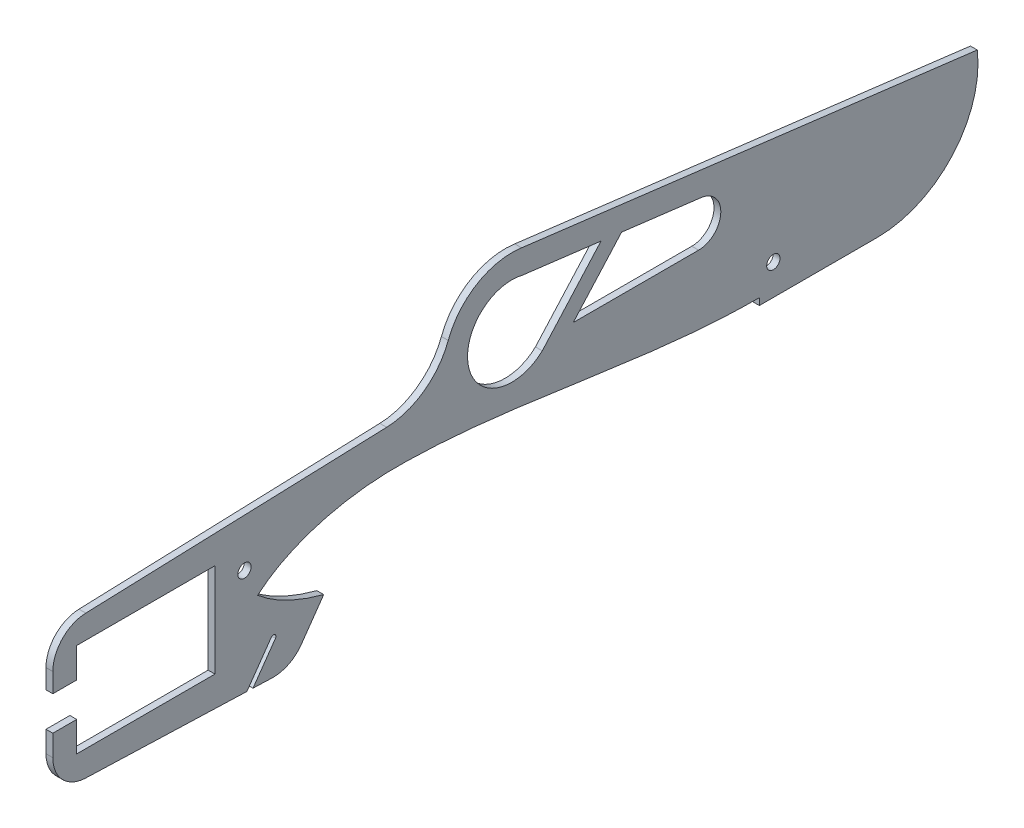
ISO-10303-21;
HEADER;
FILE_DESCRIPTION(('STEP AP214'),'2;1');
FILE_NAME('part.step','',(''),(''),'','','');
FILE_SCHEMA(('AUTOMOTIVE_DESIGN { 1 0 10303 214 1 1 1 1 }'));
ENDSEC;
DATA;
#1=APPLICATION_CONTEXT('core data for automotive mechanical design processes');
#2=APPLICATION_PROTOCOL_DEFINITION('international standard','automotive_design',2000,#1);
#3=PRODUCT_CONTEXT('',#1,'mechanical');
#4=PRODUCT('Part','Part','',(#3));
#5=PRODUCT_RELATED_PRODUCT_CATEGORY('part','',(#4));
#6=PRODUCT_DEFINITION_FORMATION('','',#4);
#7=PRODUCT_DEFINITION_CONTEXT('part definition',#1,'design');
#8=PRODUCT_DEFINITION('design','',#6,#7);
#9=PRODUCT_DEFINITION_SHAPE('','',#8);
#10=(LENGTH_UNIT() NAMED_UNIT(*) SI_UNIT(.MILLI.,.METRE.));
#11=(NAMED_UNIT(*) PLANE_ANGLE_UNIT() SI_UNIT($,.RADIAN.));
#12=(NAMED_UNIT(*) SI_UNIT($,.STERADIAN.) SOLID_ANGLE_UNIT());
#13=UNCERTAINTY_MEASURE_WITH_UNIT(LENGTH_MEASURE(1.E-05),#10,'distance_accuracy_value','');
#14=(GEOMETRIC_REPRESENTATION_CONTEXT(3) GLOBAL_UNCERTAINTY_ASSIGNED_CONTEXT((#13)) GLOBAL_UNIT_ASSIGNED_CONTEXT((#10,
#11,#12)) REPRESENTATION_CONTEXT('',''));
#15=CARTESIAN_POINT('',(0.,0.,0.));
#16=DIRECTION('',(0.,0.,1.));
#17=DIRECTION('',(1.,0.,0.));
#18=AXIS2_PLACEMENT_3D('',#15,#16,#17);
#19=CARTESIAN_POINT('',(2.,-21.2031451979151,50.3478824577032));
#20=DIRECTION('',(0.,0.99939470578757,-0.0347882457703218));
#21=DIRECTION('',(0.,0.0347882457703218,0.99939470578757));
#22=AXIS2_PLACEMENT_3D('',#19,#20,#21);
#23=PLANE('',#22);
#24=DIRECTION('',(0.,-0.0347882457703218,-0.99939470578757));
#25=VECTOR('',#24,1.);
#26=CARTESIAN_POINT('',(0.,-21.2031451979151,50.3478824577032));
#27=LINE('',#26,#25);
#28=CARTESIAN_POINT('',(0.,-21.2031451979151,50.3478824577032));
#29=VERTEX_POINT('',#28);
#30=CARTESIAN_POINT('',(0.,-22.8463212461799,3.14281629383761));
#31=VERTEX_POINT('',#30);
#32=EDGE_CURVE('E514',#29,#31,#27,.T.);
#33=ORIENTED_EDGE('',*,*,#32,.T.);
#34=DIRECTION('',(1.,0.,0.));
#35=VECTOR('',#34,1.);
#36=CARTESIAN_POINT('',(2.,-22.8463212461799,3.14281629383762));
#37=LINE('',#36,#35);
#38=CARTESIAN_POINT('',(2.,-22.8463212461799,3.14281629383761));
#39=VERTEX_POINT('',#38);
#40=EDGE_CURVE('E11',#31,#39,#37,.T.);
#41=ORIENTED_EDGE('',*,*,#40,.T.);
#42=DIRECTION('',(0.,-0.0347882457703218,-0.99939470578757));
#43=VECTOR('',#42,1.);
#44=CARTESIAN_POINT('',(2.,-21.2031451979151,50.3478824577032));
#45=LINE('',#44,#43);
#46=CARTESIAN_POINT('',(2.,-21.2031451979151,50.3478824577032));
#47=VERTEX_POINT('',#46);
#48=EDGE_CURVE('E610',#47,#39,#45,.T.);
#49=ORIENTED_EDGE('',*,*,#48,.F.);
#50=DIRECTION('',(-1.,0.,0.));
#51=VECTOR('',#50,1.);
#52=CARTESIAN_POINT('',(2.,-21.2031451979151,50.3478824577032));
#53=LINE('',#52,#51);
#54=EDGE_CURVE('E517',#47,#29,#53,.T.);
#55=ORIENTED_EDGE('',*,*,#54,.T.);
#56=EDGE_LOOP('',(#33,#41,#49,#55));
#57=FACE_BOUND('',#56,.T.);
#58=ADVANCED_FACE('F32',(#57),#23,.F.);
#59=CARTESIAN_POINT('',(2.,-5.70252850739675,-8.87915586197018));
#60=DIRECTION('',(-1.,0.,0.));
#61=DIRECTION('',(0.,0.,1.));
#62=AXIS2_PLACEMENT_3D('',#59,#60,#61);
#63=PLANE('',#62);
#64=CARTESIAN_POINT('',(2.,8.1877070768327,3.85519384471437));
#65=DIRECTION('',(1.,0.,0.));
#66=DIRECTION('',(0.,0.,-1.));
#67=AXIS2_PLACEMENT_3D('',#64,#65,#66);
#68=CIRCLE('',#67,1.95);
#69=CARTESIAN_POINT('',(2.,8.1877070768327,1.90519384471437));
#70=VERTEX_POINT('',#69);
#71=EDGE_CURVE('E290',#70,#70,#68,.T.);
#72=ORIENTED_EDGE('',*,*,#71,.F.);
#73=EDGE_LOOP('',(#72));
#74=FACE_BOUND('',#73,.T.);
#75=CARTESIAN_POINT('',(2.,29.7935484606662,-74.4949381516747));
#76=DIRECTION('',(1.,0.,0.));
#77=DIRECTION('',(0.,0.,-1.));
#78=AXIS2_PLACEMENT_3D('',#75,#76,#77);
#79=CIRCLE('',#78,13.);
#80=CARTESIAN_POINT('',(2.,42.3998471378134,-77.6700340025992));
#81=VERTEX_POINT('',#80);
#82=CARTESIAN_POINT('',(2.,20.3150756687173,-83.3920474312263));
#83=VERTEX_POINT('',#82);
#84=EDGE_CURVE('E325',#81,#83,#79,.T.);
#85=ORIENTED_EDGE('',*,*,#84,.F.);
#86=DIRECTION('',(0.,0.12305429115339,0.992399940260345));
#87=VECTOR('',#86,1.);
#88=CARTESIAN_POINT('',(2.,39.5578209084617,-100.590215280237));
#89=LINE('',#88,#87);
#90=CARTESIAN_POINT('',(2.,39.5578209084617,-100.590215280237));
#91=VERTEX_POINT('',#90);
#92=EDGE_CURVE('E331',#91,#81,#89,.T.);
#93=ORIENTED_EDGE('',*,*,#92,.F.);
#94=DIRECTION('',(0.,0.745607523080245,-0.66638534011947));
#95=VECTOR('',#94,1.);
#96=CARTESIAN_POINT('',(2.,20.3150756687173,-83.3920474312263));
#97=LINE('',#96,#95);
#98=EDGE_CURVE('E327',#83,#91,#97,.T.);
#99=ORIENTED_EDGE('',*,*,#98,.F.);
#100=EDGE_LOOP('',(#85,#93,#99));
#101=FACE_BOUND('',#100,.T.);
#102=ORIENTED_EDGE('',*,*,#48,.T.);
#103=DIRECTION('',(0.,0.818234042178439,-0.574885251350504));
#104=VECTOR('',#103,1.);
#105=CARTESIAN_POINT('',(2.,-12.6791192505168,-4.00058543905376));
#106=LINE('',#105,#104);
#107=CARTESIAN_POINT('',(2.,-12.6791192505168,-4.00058543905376));
#108=VERTEX_POINT('',#107);
#109=EDGE_CURVE('E264',#39,#108,#106,.T.);
#110=ORIENTED_EDGE('',*,*,#109,.T.);
#111=CARTESIAN_POINT('',(2.,-13.1102831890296,-4.61426097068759));
#112=DIRECTION('',(-1.,0.,0.));
#113=DIRECTION('',(0.,0.,1.));
#114=AXIS2_PLACEMENT_3D('',#111,#112,#113);
#115=CIRCLE('',#114,0.75);
#116=CARTESIAN_POINT('',(2.,-13.5414471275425,-5.22793650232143));
#117=VERTEX_POINT('',#116);
#118=EDGE_CURVE('E259',#108,#117,#115,.T.);
#119=ORIENTED_EDGE('',*,*,#118,.T.);
#120=DIRECTION('',(0.,-0.818234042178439,0.574885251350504));
#121=VECTOR('',#120,1.);
#122=CARTESIAN_POINT('',(2.,-23.9698274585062,2.09896721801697));
#123=LINE('',#122,#121);
#124=CARTESIAN_POINT('',(2.,-22.908610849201,1.35336419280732));
#125=VERTEX_POINT('',#124);
#126=EDGE_CURVE('E267',#117,#125,#123,.T.);
#127=ORIENTED_EDGE('',*,*,#126,.T.);
#128=CARTESIAN_POINT('',(2.,-23.1042302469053,-4.26637851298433));
#129=VERTEX_POINT('',#128);
#130=EDGE_CURVE('E598',#125,#129,#45,.T.);
#131=ORIENTED_EDGE('',*,*,#130,.T.);
#132=CARTESIAN_POINT('',(2.,-13.1102831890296,-4.61426097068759));
#133=DIRECTION('',(1.,0.,0.));
#134=DIRECTION('',(0.,0.,1.));
#135=AXIS2_PLACEMENT_3D('',#132,#133,#134);
#136=CIRCLE('',#135,10.);
#137=CARTESIAN_POINT('',(2.,-18.8591357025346,-12.796601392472));
#138=VERTEX_POINT('',#137);
#139=EDGE_CURVE('E608',#129,#138,#136,.T.);
#140=ORIENTED_EDGE('',*,*,#139,.T.);
#141=DIRECTION('',(0.,0.818234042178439,-0.574885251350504));
#142=VECTOR('',#141,1.);
#143=CARTESIAN_POINT('',(2.,-18.8591357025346,-12.796601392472));
#144=LINE('',#143,#142);
#145=CARTESIAN_POINT('',(2.,-9.51292470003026,-19.3631808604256));
#146=VERTEX_POINT('',#145);
#147=EDGE_CURVE('E533',#138,#146,#144,.T.);
#148=ORIENTED_EDGE('',*,*,#147,.T.);
#149=CARTESIAN_POINT('',(2.,-9.51292470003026,-19.3631808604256));
#150=CARTESIAN_POINT('',(2.,-7.56237200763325,-12.0547036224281));
#151=CARTESIAN_POINT('',(2.,-4.473395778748,-5.16865172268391));
#152=CARTESIAN_POINT('',(2.,0.,0.));
#153=B_SPLINE_CURVE_WITH_KNOTS('',3,(#149,#150,#151,#152),.UNSPECIFIED.,.F.,.F.,(4,4),(0.,
0.144432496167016),.UNSPECIFIED.);
#154=CARTESIAN_POINT('',(2.,0.,0.));
#155=VERTEX_POINT('',#154);
#156=EDGE_CURVE('E348',#146,#155,#153,.T.);
#157=ORIENTED_EDGE('',*,*,#156,.T.);
#158=CARTESIAN_POINT('',(2.,0.,0.));
#159=CARTESIAN_POINT('',(2.,8.67468810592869,-10.0229096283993));
#160=CARTESIAN_POINT('',(2.,12.1434163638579,-26.5039167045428));
#161=CARTESIAN_POINT('',(2.,12.2542951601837,-52.9502459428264));
#162=CARTESIAN_POINT('',(2.,8.34982454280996,-89.338205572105));
#163=CARTESIAN_POINT('',(2.,2.0116703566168,-124.878889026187));
#164=CARTESIAN_POINT('',(2.,2.,-147.));
#165=B_SPLINE_CURVE_WITH_KNOTS('',3,(#158,#159,#160,#161,#162,#163,#164),.UNSPECIFIED.,.F.,.F.,
(4,2,1,4),(0.,0.280079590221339,0.548831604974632,1.),.UNSPECIFIED.);
#166=CARTESIAN_POINT('',(2.,2.,-147.));
#167=VERTEX_POINT('',#166);
#168=EDGE_CURVE('E354',#155,#167,#165,.T.);
#169=ORIENTED_EDGE('',*,*,#168,.T.);
#170=DIRECTION('',(0.,-1.,0.));
#171=VECTOR('',#170,1.);
#172=CARTESIAN_POINT('',(2.,0.,-147.));
#173=LINE('',#172,#171);
#174=CARTESIAN_POINT('',(2.,0.,-147.));
#175=VERTEX_POINT('',#174);
#176=EDGE_CURVE('E363',#167,#175,#173,.T.);
#177=ORIENTED_EDGE('',*,*,#176,.T.);
#178=DIRECTION('',(0.,0.,-1.));
#179=VECTOR('',#178,1.);
#180=CARTESIAN_POINT('',(2.,0.,-181.591574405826));
#181=LINE('',#180,#179);
#182=CARTESIAN_POINT('',(2.,0.,-181.591574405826));
#183=VERTEX_POINT('',#182);
#184=EDGE_CURVE('E702',#175,#183,#181,.T.);
#185=ORIENTED_EDGE('',*,*,#184,.T.);
#186=CARTESIAN_POINT('',(2.,29.4592694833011,-181.591574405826));
#187=DIRECTION('',(1.,0.,0.));
#188=DIRECTION('',(0.,0.,-1.));
#189=AXIS2_PLACEMENT_3D('',#186,#187,#188);
#190=CIRCLE('',#189,29.4592694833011);
#191=CARTESIAN_POINT('',(2.,32.9306158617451,-210.845605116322));
#192=VERTEX_POINT('',#191);
#193=EDGE_CURVE('E701',#183,#192,#190,.T.);
#194=ORIENTED_EDGE('',*,*,#193,.T.);
#195=DIRECTION('',(0.,0.123054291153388,0.992399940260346));
#196=VECTOR('',#195,1.);
#197=CARTESIAN_POINT('',(2.,32.9306158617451,-210.845605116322));
#198=LINE('',#197,#196);
#199=CARTESIAN_POINT('',(2.,49.4858824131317,-77.3318090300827));
#200=VERTEX_POINT('',#199);
#201=EDGE_CURVE('E699',#192,#200,#198,.T.);
#202=ORIENTED_EDGE('',*,*,#201,.T.);
#203=CARTESIAN_POINT('',(2.,29.7935484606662,-74.4949381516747));
#204=DIRECTION('',(1.,0.,0.));
#205=DIRECTION('',(0.,0.,-1.));
#206=AXIS2_PLACEMENT_3D('',#203,#204,#205);
#207=CIRCLE('',#206,19.895623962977);
#208=CARTESIAN_POINT('',(2.,36.7297761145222,-55.8475630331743));
#209=VERTEX_POINT('',#208);
#210=EDGE_CURVE('E697',#200,#209,#207,.T.);
#211=ORIENTED_EDGE('',*,*,#210,.T.);
#212=CARTESIAN_POINT('',(2.,43.7023924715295,-37.1023604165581));
#213=DIRECTION('',(-1.,0.,0.));
#214=DIRECTION('',(0.,0.,-1.));
#215=AXIS2_PLACEMENT_3D('',#212,#213,#214);
#216=CIRCLE('',#215,20.);
#217=CARTESIAN_POINT('',(2.,23.7144983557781,-37.7981253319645));
#218=VERTEX_POINT('',#217);
#219=EDGE_CURVE('E695',#209,#218,#216,.T.);
#220=ORIENTED_EDGE('',*,*,#219,.T.);
#221=DIRECTION('',(0.,-0.0347882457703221,0.99939470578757));
#222=VECTOR('',#221,1.);
#223=CARTESIAN_POINT('',(2.,20.6461961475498,50.3478824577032));
#224=LINE('',#223,#222);
#225=CARTESIAN_POINT('',(2.,20.6461961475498,50.3478824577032));
#226=VERTEX_POINT('',#225);
#227=EDGE_CURVE('E693',#218,#226,#224,.T.);
#228=ORIENTED_EDGE('',*,*,#227,.T.);
#229=CARTESIAN_POINT('',(2.,10.6522490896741,50.));
#230=DIRECTION('',(1.,0.,0.));
#231=DIRECTION('',(0.,0.,-1.));
#232=AXIS2_PLACEMENT_3D('',#229,#230,#231);
#233=CIRCLE('',#232,10.);
#234=CARTESIAN_POINT('',(2.,10.6522490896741,60.));
#235=VERTEX_POINT('',#234);
#236=EDGE_CURVE('E691',#226,#235,#233,.T.);
#237=ORIENTED_EDGE('',*,*,#236,.T.);
#238=DIRECTION('',(0.,-1.,0.));
#239=VECTOR('',#238,1.);
#240=CARTESIAN_POINT('',(2.,10.6522490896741,60.));
#241=LINE('',#240,#239);
#242=CARTESIAN_POINT('',(2.,5.,60.));
#243=VERTEX_POINT('',#242);
#244=EDGE_CURVE('E689',#235,#243,#241,.T.);
#245=ORIENTED_EDGE('',*,*,#244,.T.);
#246=DIRECTION('',(0.,0.,-1.));
#247=VECTOR('',#246,1.);
#248=CARTESIAN_POINT('',(2.,5.,60.));
#249=LINE('',#248,#247);
#250=CARTESIAN_POINT('',(2.,5.,53.));
#251=VERTEX_POINT('',#250);
#252=EDGE_CURVE('E687',#243,#251,#249,.T.);
#253=ORIENTED_EDGE('',*,*,#252,.T.);
#254=DIRECTION('',(0.,1.,0.));
#255=VECTOR('',#254,1.);
#256=CARTESIAN_POINT('',(2.,13.75,53.));
#257=LINE('',#256,#255);
#258=CARTESIAN_POINT('',(2.,13.75,53.));
#259=VERTEX_POINT('',#258);
#260=EDGE_CURVE('E685',#251,#259,#257,.T.);
#261=ORIENTED_EDGE('',*,*,#260,.T.);
#262=DIRECTION('',(0.,0.,-1.));
#263=VECTOR('',#262,1.);
#264=CARTESIAN_POINT('',(2.,13.75,53.));
#265=LINE('',#264,#263);
#266=CARTESIAN_POINT('',(2.,13.75,12.5));
#267=VERTEX_POINT('',#266);
#268=EDGE_CURVE('E683',#259,#267,#265,.T.);
#269=ORIENTED_EDGE('',*,*,#268,.T.);
#270=DIRECTION('',(0.,-1.,0.));
#271=VECTOR('',#270,1.);
#272=CARTESIAN_POINT('',(2.,13.75,12.5));
#273=LINE('',#272,#271);
#274=CARTESIAN_POINT('',(2.,-13.75,12.5));
#275=VERTEX_POINT('',#274);
#276=EDGE_CURVE('E681',#267,#275,#273,.T.);
#277=ORIENTED_EDGE('',*,*,#276,.T.);
#278=DIRECTION('',(0.,0.,1.));
#279=VECTOR('',#278,1.);
#280=CARTESIAN_POINT('',(2.,-13.75,53.));
#281=LINE('',#280,#279);
#282=CARTESIAN_POINT('',(2.,-13.75,53.));
#283=VERTEX_POINT('',#282);
#284=EDGE_CURVE('E679',#275,#283,#281,.T.);
#285=ORIENTED_EDGE('',*,*,#284,.T.);
#286=DIRECTION('',(0.,1.,0.));
#287=VECTOR('',#286,1.);
#288=CARTESIAN_POINT('',(2.,-5.,53.));
#289=LINE('',#288,#287);
#290=CARTESIAN_POINT('',(2.,-5.,53.));
#291=VERTEX_POINT('',#290);
#292=EDGE_CURVE('E675',#283,#291,#289,.T.);
#293=ORIENTED_EDGE('',*,*,#292,.T.);
#294=DIRECTION('',(0.,0.,1.));
#295=VECTOR('',#294,1.);
#296=CARTESIAN_POINT('',(2.,-5.,60.));
#297=LINE('',#296,#295);
#298=CARTESIAN_POINT('',(2.,-5.,60.));
#299=VERTEX_POINT('',#298);
#300=EDGE_CURVE('E672',#291,#299,#297,.T.);
#301=ORIENTED_EDGE('',*,*,#300,.T.);
#302=DIRECTION('',(0.,-1.,0.));
#303=VECTOR('',#302,1.);
#304=CARTESIAN_POINT('',(2.,-5.,60.));
#305=LINE('',#304,#303);
#306=CARTESIAN_POINT('',(2.,-11.2091981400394,60.));
#307=VERTEX_POINT('',#306);
#308=EDGE_CURVE('E670',#299,#307,#305,.T.);
#309=ORIENTED_EDGE('',*,*,#308,.T.);
#310=CARTESIAN_POINT('',(2.,-11.2091981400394,50.));
#311=DIRECTION('',(1.,0.,0.));
#312=DIRECTION('',(0.,0.,1.));
#313=AXIS2_PLACEMENT_3D('',#310,#311,#312);
#314=CIRCLE('',#313,10.);
#315=EDGE_CURVE('E671',#307,#47,#314,.T.);
#316=ORIENTED_EDGE('',*,*,#315,.T.);
#317=EDGE_LOOP('',(#102,#110,#119,#127,#131,#140,#148,#157,#169,#177,#185,#194,#202,#211,#220,
#228,#237,#245,#253,#261,#269,#277,#285,#293,#301,#309,#316));
#318=FACE_BOUND('',#317,.T.);
#319=DIRECTION('',(0.,0.12305429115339,0.992399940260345));
#320=VECTOR('',#319,1.);
#321=CARTESIAN_POINT('',(2.,35.9106898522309,-130.003351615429));
#322=LINE('',#321,#320);
#323=CARTESIAN_POINT('',(2.,35.9106898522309,-130.003351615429));
#324=VERTEX_POINT('',#323);
#325=CARTESIAN_POINT('',(2.,38.8092630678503,-106.62713402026));
#326=VERTEX_POINT('',#325);
#327=EDGE_CURVE('E296',#324,#326,#322,.T.);
#328=ORIENTED_EDGE('',*,*,#327,.F.);
#329=CARTESIAN_POINT('',(2.,29.4592694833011,-129.203396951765));
#330=DIRECTION('',(1.,0.,0.));
#331=DIRECTION('',(0.,0.,-1.));
#332=AXIS2_PLACEMENT_3D('',#329,#330,#331);
#333=CIRCLE('',#332,6.50082704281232);
#334=CARTESIAN_POINT('',(2.,22.9584424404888,-129.203396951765));
#335=VERTEX_POINT('',#334);
#336=EDGE_CURVE('E303',#335,#324,#333,.T.);
#337=ORIENTED_EDGE('',*,*,#336,.F.);
#338=DIRECTION('',(0.,0.,-1.));
#339=VECTOR('',#338,1.);
#340=CARTESIAN_POINT('',(2.,22.9584424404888,-92.4604924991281));
#341=LINE('',#340,#339);
#342=CARTESIAN_POINT('',(2.,22.9584424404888,-92.4604924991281));
#343=VERTEX_POINT('',#342);
#344=EDGE_CURVE('E301',#343,#335,#341,.T.);
#345=ORIENTED_EDGE('',*,*,#344,.F.);
#346=DIRECTION('',(0.,-0.745607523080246,0.66638534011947));
#347=VECTOR('',#346,1.);
#348=CARTESIAN_POINT('',(2.,38.8092630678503,-106.62713402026));
#349=LINE('',#348,#347);
#350=EDGE_CURVE('E298',#326,#343,#349,.T.);
#351=ORIENTED_EDGE('',*,*,#350,.F.);
#352=EDGE_LOOP('',(#328,#337,#345,#351));
#353=FACE_BOUND('',#352,.T.);
#354=CARTESIAN_POINT('',(2.,9.,-151.089942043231));
#355=DIRECTION('',(1.,0.,0.));
#356=DIRECTION('',(0.,0.,-1.));
#357=AXIS2_PLACEMENT_3D('',#354,#355,#356);
#358=CIRCLE('',#357,1.95);
#359=CARTESIAN_POINT('',(2.,9.,-153.039942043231));
#360=VERTEX_POINT('',#359);
#361=EDGE_CURVE('E284',#360,#360,#358,.T.);
#362=ORIENTED_EDGE('',*,*,#361,.F.);
#363=EDGE_LOOP('',(#362));
#364=FACE_BOUND('',#363,.T.);
#365=ADVANCED_FACE('F273',(#74,#101,#318,#353,#364),#63,.F.);
#366=CARTESIAN_POINT('',(0.,-5.70252850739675,-8.87915586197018));
#367=DIRECTION('',(-1.,0.,0.));
#368=DIRECTION('',(0.,0.,1.));
#369=AXIS2_PLACEMENT_3D('',#366,#367,#368);
#370=PLANE('',#369);
#371=DIRECTION('',(0.,0.818234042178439,-0.574885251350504));
#372=VECTOR('',#371,1.);
#373=CARTESIAN_POINT('',(0.,-12.6791192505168,-4.00058543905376));
#374=LINE('',#373,#372);
#375=CARTESIAN_POINT('',(0.,-12.6791192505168,-4.00058543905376));
#376=VERTEX_POINT('',#375);
#377=EDGE_CURVE('E275',#31,#376,#374,.T.);
#378=ORIENTED_EDGE('',*,*,#377,.F.);
#379=ORIENTED_EDGE('',*,*,#32,.F.);
#380=CARTESIAN_POINT('',(0.,-11.2091981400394,50.));
#381=DIRECTION('',(1.,0.,0.));
#382=DIRECTION('',(0.,0.,1.));
#383=AXIS2_PLACEMENT_3D('',#380,#381,#382);
#384=CIRCLE('',#383,10.);
#385=CARTESIAN_POINT('',(0.,-11.2091981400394,60.));
#386=VERTEX_POINT('',#385);
#387=EDGE_CURVE('E524',#386,#29,#384,.T.);
#388=ORIENTED_EDGE('',*,*,#387,.F.);
#389=DIRECTION('',(0.,-1.,0.));
#390=VECTOR('',#389,1.);
#391=CARTESIAN_POINT('',(0.,-5.,60.));
#392=LINE('',#391,#390);
#393=CARTESIAN_POINT('',(0.,-5.,60.));
#394=VERTEX_POINT('',#393);
#395=EDGE_CURVE('E659',#394,#386,#392,.T.);
#396=ORIENTED_EDGE('',*,*,#395,.F.);
#397=DIRECTION('',(0.,0.,1.));
#398=VECTOR('',#397,1.);
#399=CARTESIAN_POINT('',(0.,-5.,60.));
#400=LINE('',#399,#398);
#401=CARTESIAN_POINT('',(0.,-5.,53.));
#402=VERTEX_POINT('',#401);
#403=EDGE_CURVE('E658',#402,#394,#400,.T.);
#404=ORIENTED_EDGE('',*,*,#403,.F.);
#405=DIRECTION('',(0.,1.,0.));
#406=VECTOR('',#405,1.);
#407=CARTESIAN_POINT('',(0.,-5.,53.));
#408=LINE('',#407,#406);
#409=CARTESIAN_POINT('',(0.,-13.75,53.));
#410=VERTEX_POINT('',#409);
#411=EDGE_CURVE('E656',#410,#402,#408,.T.);
#412=ORIENTED_EDGE('',*,*,#411,.F.);
#413=DIRECTION('',(0.,0.,1.));
#414=VECTOR('',#413,1.);
#415=CARTESIAN_POINT('',(0.,-13.75,53.));
#416=LINE('',#415,#414);
#417=CARTESIAN_POINT('',(0.,-13.75,12.5));
#418=VERTEX_POINT('',#417);
#419=EDGE_CURVE('E654',#418,#410,#416,.T.);
#420=ORIENTED_EDGE('',*,*,#419,.F.);
#421=DIRECTION('',(0.,-1.,0.));
#422=VECTOR('',#421,1.);
#423=CARTESIAN_POINT('',(0.,13.75,12.5));
#424=LINE('',#423,#422);
#425=CARTESIAN_POINT('',(0.,13.75,12.5));
#426=VERTEX_POINT('',#425);
#427=EDGE_CURVE('E652',#426,#418,#424,.T.);
#428=ORIENTED_EDGE('',*,*,#427,.F.);
#429=DIRECTION('',(0.,0.,-1.));
#430=VECTOR('',#429,1.);
#431=CARTESIAN_POINT('',(0.,13.75,53.));
#432=LINE('',#431,#430);
#433=CARTESIAN_POINT('',(0.,13.75,53.));
#434=VERTEX_POINT('',#433);
#435=EDGE_CURVE('E650',#434,#426,#432,.T.);
#436=ORIENTED_EDGE('',*,*,#435,.F.);
#437=DIRECTION('',(0.,1.,0.));
#438=VECTOR('',#437,1.);
#439=CARTESIAN_POINT('',(0.,13.75,53.));
#440=LINE('',#439,#438);
#441=CARTESIAN_POINT('',(0.,5.,53.));
#442=VERTEX_POINT('',#441);
#443=EDGE_CURVE('E648',#442,#434,#440,.T.);
#444=ORIENTED_EDGE('',*,*,#443,.F.);
#445=DIRECTION('',(0.,0.,-1.));
#446=VECTOR('',#445,1.);
#447=CARTESIAN_POINT('',(0.,5.,60.));
#448=LINE('',#447,#446);
#449=CARTESIAN_POINT('',(0.,5.,60.));
#450=VERTEX_POINT('',#449);
#451=EDGE_CURVE('E646',#450,#442,#448,.T.);
#452=ORIENTED_EDGE('',*,*,#451,.F.);
#453=DIRECTION('',(0.,-1.,0.));
#454=VECTOR('',#453,1.);
#455=CARTESIAN_POINT('',(0.,10.6522490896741,60.));
#456=LINE('',#455,#454);
#457=CARTESIAN_POINT('',(0.,10.6522490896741,60.));
#458=VERTEX_POINT('',#457);
#459=EDGE_CURVE('E644',#458,#450,#456,.T.);
#460=ORIENTED_EDGE('',*,*,#459,.F.);
#461=CARTESIAN_POINT('',(0.,10.6522490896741,50.));
#462=DIRECTION('',(1.,0.,0.));
#463=DIRECTION('',(0.,0.,-1.));
#464=AXIS2_PLACEMENT_3D('',#461,#462,#463);
#465=CIRCLE('',#464,10.);
#466=CARTESIAN_POINT('',(0.,20.6461961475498,50.3478824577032));
#467=VERTEX_POINT('',#466);
#468=EDGE_CURVE('E642',#467,#458,#465,.T.);
#469=ORIENTED_EDGE('',*,*,#468,.F.);
#470=DIRECTION('',(0.,-0.0347882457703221,0.99939470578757));
#471=VECTOR('',#470,1.);
#472=CARTESIAN_POINT('',(0.,20.6461961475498,50.3478824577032));
#473=LINE('',#472,#471);
#474=CARTESIAN_POINT('',(0.,23.7144983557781,-37.7981253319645));
#475=VERTEX_POINT('',#474);
#476=EDGE_CURVE('E640',#475,#467,#473,.T.);
#477=ORIENTED_EDGE('',*,*,#476,.F.);
#478=CARTESIAN_POINT('',(0.,43.7023924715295,-37.1023604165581));
#479=DIRECTION('',(-1.,0.,0.));
#480=DIRECTION('',(0.,0.,-1.));
#481=AXIS2_PLACEMENT_3D('',#478,#479,#480);
#482=CIRCLE('',#481,20.);
#483=CARTESIAN_POINT('',(0.,36.7297761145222,-55.8475630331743));
#484=VERTEX_POINT('',#483);
#485=EDGE_CURVE('E638',#484,#475,#482,.T.);
#486=ORIENTED_EDGE('',*,*,#485,.F.);
#487=CARTESIAN_POINT('',(0.,29.7935484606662,-74.4949381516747));
#488=DIRECTION('',(1.,0.,0.));
#489=DIRECTION('',(0.,0.,-1.));
#490=AXIS2_PLACEMENT_3D('',#487,#488,#489);
#491=CIRCLE('',#490,19.895623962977);
#492=CARTESIAN_POINT('',(0.,49.4858824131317,-77.3318090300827));
#493=VERTEX_POINT('',#492);
#494=EDGE_CURVE('E636',#493,#484,#491,.T.);
#495=ORIENTED_EDGE('',*,*,#494,.F.);
#496=DIRECTION('',(0.,0.123054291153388,0.992399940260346));
#497=VECTOR('',#496,1.);
#498=CARTESIAN_POINT('',(0.,32.9306158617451,-210.845605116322));
#499=LINE('',#498,#497);
#500=CARTESIAN_POINT('',(0.,32.9306158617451,-210.845605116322));
#501=VERTEX_POINT('',#500);
#502=EDGE_CURVE('E634',#501,#493,#499,.T.);
#503=ORIENTED_EDGE('',*,*,#502,.F.);
#504=CARTESIAN_POINT('',(0.,29.4592694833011,-181.591574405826));
#505=DIRECTION('',(1.,0.,0.));
#506=DIRECTION('',(0.,0.,-1.));
#507=AXIS2_PLACEMENT_3D('',#504,#505,#506);
#508=CIRCLE('',#507,29.4592694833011);
#509=CARTESIAN_POINT('',(0.,0.,-181.591574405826));
#510=VERTEX_POINT('',#509);
#511=EDGE_CURVE('E632',#510,#501,#508,.T.);
#512=ORIENTED_EDGE('',*,*,#511,.F.);
#513=DIRECTION('',(0.,0.,-1.));
#514=VECTOR('',#513,1.);
#515=CARTESIAN_POINT('',(0.,0.,-181.591574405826));
#516=LINE('',#515,#514);
#517=CARTESIAN_POINT('',(0.,0.,-147.));
#518=VERTEX_POINT('',#517);
#519=EDGE_CURVE('E630',#518,#510,#516,.T.);
#520=ORIENTED_EDGE('',*,*,#519,.F.);
#521=DIRECTION('',(0.,-1.,0.));
#522=VECTOR('',#521,1.);
#523=CARTESIAN_POINT('',(0.,0.,-147.));
#524=LINE('',#523,#522);
#525=CARTESIAN_POINT('',(0.,2.,-147.));
#526=VERTEX_POINT('',#525);
#527=EDGE_CURVE('E625',#526,#518,#524,.T.);
#528=ORIENTED_EDGE('',*,*,#527,.F.);
#529=CARTESIAN_POINT('',(0.,0.,0.));
#530=CARTESIAN_POINT('',(0.,8.67468810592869,-10.0229096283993));
#531=CARTESIAN_POINT('',(0.,12.1434163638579,-26.5039167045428));
#532=CARTESIAN_POINT('',(0.,12.2542951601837,-52.9502459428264));
#533=CARTESIAN_POINT('',(0.,8.34982454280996,-89.338205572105));
#534=CARTESIAN_POINT('',(0.,2.0116703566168,-124.878889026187));
#535=CARTESIAN_POINT('',(0.,2.,-147.));
#536=B_SPLINE_CURVE_WITH_KNOTS('',3,(#529,#530,#531,#532,#533,#534,#535),.UNSPECIFIED.,.F.,.F.,
(4,2,1,4),(0.,0.280079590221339,0.548831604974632,1.),.UNSPECIFIED.);
#537=CARTESIAN_POINT('',(0.,0.,0.));
#538=VERTEX_POINT('',#537);
#539=EDGE_CURVE('E618',#538,#526,#536,.T.);
#540=ORIENTED_EDGE('',*,*,#539,.F.);
#541=CARTESIAN_POINT('',(0.,-9.51292470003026,-19.3631808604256));
#542=CARTESIAN_POINT('',(0.,-7.56237200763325,-12.0547036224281));
#543=CARTESIAN_POINT('',(0.,-4.473395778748,-5.16865172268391));
#544=CARTESIAN_POINT('',(0.,0.,0.));
#545=B_SPLINE_CURVE_WITH_KNOTS('',3,(#541,#542,#543,#544),.UNSPECIFIED.,.F.,.F.,(4,4),(0.,
0.144432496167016),.UNSPECIFIED.);
#546=CARTESIAN_POINT('',(0.,-9.51292470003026,-19.3631808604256));
#547=VERTEX_POINT('',#546);
#548=EDGE_CURVE('E347',#547,#538,#545,.T.);
#549=ORIENTED_EDGE('',*,*,#548,.F.);
#550=DIRECTION('',(0.,0.818234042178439,-0.574885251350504));
#551=VECTOR('',#550,1.);
#552=CARTESIAN_POINT('',(0.,-18.8591357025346,-12.796601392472));
#553=LINE('',#552,#551);
#554=CARTESIAN_POINT('',(0.,-18.8591357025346,-12.796601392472));
#555=VERTEX_POINT('',#554);
#556=EDGE_CURVE('E355',#555,#547,#553,.T.);
#557=ORIENTED_EDGE('',*,*,#556,.F.);
#558=CARTESIAN_POINT('',(0.,-13.1102831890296,-4.61426097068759));
#559=DIRECTION('',(1.,0.,0.));
#560=DIRECTION('',(0.,0.,1.));
#561=AXIS2_PLACEMENT_3D('',#558,#559,#560);
#562=CIRCLE('',#561,10.);
#563=CARTESIAN_POINT('',(0.,-23.1042302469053,-4.26637851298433));
#564=VERTEX_POINT('',#563);
#565=EDGE_CURVE('E520',#564,#555,#562,.T.);
#566=ORIENTED_EDGE('',*,*,#565,.F.);
#567=CARTESIAN_POINT('',(0.,-22.908610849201,1.35336419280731));
#568=VERTEX_POINT('',#567);
#569=EDGE_CURVE('E521',#568,#564,#27,.T.);
#570=ORIENTED_EDGE('',*,*,#569,.F.);
#571=DIRECTION('',(0.,-0.818234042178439,0.574885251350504));
#572=VECTOR('',#571,1.);
#573=CARTESIAN_POINT('',(0.,-23.9698274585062,2.09896721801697));
#574=LINE('',#573,#572);
#575=CARTESIAN_POINT('',(0.,-13.5414471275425,-5.22793650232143));
#576=VERTEX_POINT('',#575);
#577=EDGE_CURVE('E48',#576,#568,#574,.T.);
#578=ORIENTED_EDGE('',*,*,#577,.F.);
#579=CARTESIAN_POINT('',(0.,-13.1102831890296,-4.61426097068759));
#580=DIRECTION('',(-1.,0.,0.));
#581=DIRECTION('',(0.,0.,1.));
#582=AXIS2_PLACEMENT_3D('',#579,#580,#581);
#583=CIRCLE('',#582,0.75);
#584=EDGE_CURVE('E262',#376,#576,#583,.T.);
#585=ORIENTED_EDGE('',*,*,#584,.F.);
#586=EDGE_LOOP('',(#378,#379,#388,#396,#404,#412,#420,#428,#436,#444,#452,#460,#469,#477,#486,
#495,#503,#512,#520,#528,#540,#549,#557,#566,#570,#578,#585));
#587=FACE_BOUND('',#586,.T.);
#588=CARTESIAN_POINT('',(0.,8.1877070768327,3.85519384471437));
#589=DIRECTION('',(1.,0.,0.));
#590=DIRECTION('',(0.,0.,-1.));
#591=AXIS2_PLACEMENT_3D('',#588,#589,#590);
#592=CIRCLE('',#591,1.95);
#593=CARTESIAN_POINT('',(0.,8.1877070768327,1.90519384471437));
#594=VERTEX_POINT('',#593);
#595=EDGE_CURVE('E287',#594,#594,#592,.T.);
#596=ORIENTED_EDGE('',*,*,#595,.T.);
#597=EDGE_LOOP('',(#596));
#598=FACE_BOUND('',#597,.T.);
#599=DIRECTION('',(0.,0.12305429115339,0.992399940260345));
#600=VECTOR('',#599,1.);
#601=CARTESIAN_POINT('',(0.,39.5578209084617,-100.590215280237));
#602=LINE('',#601,#600);
#603=CARTESIAN_POINT('',(0.,39.5578209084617,-100.590215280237));
#604=VERTEX_POINT('',#603);
#605=CARTESIAN_POINT('',(0.,42.3998471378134,-77.6700340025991));
#606=VERTEX_POINT('',#605);
#607=EDGE_CURVE('E328',#604,#606,#602,.T.);
#608=ORIENTED_EDGE('',*,*,#607,.T.);
#609=CARTESIAN_POINT('',(0.,29.7935484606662,-74.4949381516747));
#610=DIRECTION('',(1.,0.,0.));
#611=DIRECTION('',(0.,0.,-1.));
#612=AXIS2_PLACEMENT_3D('',#609,#610,#611);
#613=CIRCLE('',#612,13.);
#614=CARTESIAN_POINT('',(0.,20.3150756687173,-83.3920474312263));
#615=VERTEX_POINT('',#614);
#616=EDGE_CURVE('E324',#606,#615,#613,.T.);
#617=ORIENTED_EDGE('',*,*,#616,.T.);
#618=DIRECTION('',(0.,0.745607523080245,-0.66638534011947));
#619=VECTOR('',#618,1.);
#620=CARTESIAN_POINT('',(0.,20.3150756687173,-83.3920474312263));
#621=LINE('',#620,#619);
#622=EDGE_CURVE('E336',#615,#604,#621,.T.);
#623=ORIENTED_EDGE('',*,*,#622,.T.);
#624=EDGE_LOOP('',(#608,#617,#623));
#625=FACE_BOUND('',#624,.T.);
#626=CARTESIAN_POINT('',(0.,29.4592694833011,-129.203396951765));
#627=DIRECTION('',(1.,0.,0.));
#628=DIRECTION('',(0.,0.,-1.));
#629=AXIS2_PLACEMENT_3D('',#626,#627,#628);
#630=CIRCLE('',#629,6.50082704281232);
#631=CARTESIAN_POINT('',(0.,22.9584424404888,-129.203396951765));
#632=VERTEX_POINT('',#631);
#633=CARTESIAN_POINT('',(0.,35.9106898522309,-130.003351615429));
#634=VERTEX_POINT('',#633);
#635=EDGE_CURVE('E299',#632,#634,#630,.T.);
#636=ORIENTED_EDGE('',*,*,#635,.T.);
#637=DIRECTION('',(0.,0.12305429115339,0.992399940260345));
#638=VECTOR('',#637,1.);
#639=CARTESIAN_POINT('',(0.,35.9106898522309,-130.003351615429));
#640=LINE('',#639,#638);
#641=CARTESIAN_POINT('',(0.,38.8092630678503,-106.62713402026));
#642=VERTEX_POINT('',#641);
#643=EDGE_CURVE('E293',#634,#642,#640,.T.);
#644=ORIENTED_EDGE('',*,*,#643,.T.);
#645=DIRECTION('',(0.,-0.745607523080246,0.66638534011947));
#646=VECTOR('',#645,1.);
#647=CARTESIAN_POINT('',(0.,38.8092630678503,-106.62713402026));
#648=LINE('',#647,#646);
#649=CARTESIAN_POINT('',(0.,22.9584424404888,-92.4604924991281));
#650=VERTEX_POINT('',#649);
#651=EDGE_CURVE('E308',#642,#650,#648,.T.);
#652=ORIENTED_EDGE('',*,*,#651,.T.);
#653=DIRECTION('',(0.,0.,-1.));
#654=VECTOR('',#653,1.);
#655=CARTESIAN_POINT('',(0.,22.9584424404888,-92.4604924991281));
#656=LINE('',#655,#654);
#657=EDGE_CURVE('E311',#650,#632,#656,.T.);
#658=ORIENTED_EDGE('',*,*,#657,.T.);
#659=EDGE_LOOP('',(#636,#644,#652,#658));
#660=FACE_BOUND('',#659,.T.);
#661=CARTESIAN_POINT('',(0.,9.,-151.089942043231));
#662=DIRECTION('',(1.,0.,0.));
#663=DIRECTION('',(0.,0.,-1.));
#664=AXIS2_PLACEMENT_3D('',#661,#662,#663);
#665=CIRCLE('',#664,1.95);
#666=CARTESIAN_POINT('',(0.,9.,-153.039942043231));
#667=VERTEX_POINT('',#666);
#668=EDGE_CURVE('E282',#667,#667,#665,.T.);
#669=ORIENTED_EDGE('',*,*,#668,.T.);
#670=EDGE_LOOP('',(#669));
#671=FACE_BOUND('',#670,.T.);
#672=ADVANCED_FACE('F457',(#587,#598,#625,#660,#671),#370,.T.);
#673=DIRECTION('',(-1.,0.,0.));
#674=VECTOR('',#673,1.);
#675=SURFACE_OF_LINEAR_EXTRUSION('',#153,#674);
#676=ORIENTED_EDGE('',*,*,#548,.T.);
#677=DIRECTION('',(-1.,0.,0.));
#678=VECTOR('',#677,1.);
#679=CARTESIAN_POINT('',(2.,0.,0.));
#680=LINE('',#679,#678);
#681=EDGE_CURVE('E594',#155,#538,#680,.T.);
#682=ORIENTED_EDGE('',*,*,#681,.F.);
#683=ORIENTED_EDGE('',*,*,#156,.F.);
#684=DIRECTION('',(-1.,0.,0.));
#685=VECTOR('',#684,1.);
#686=CARTESIAN_POINT('',(2.,-9.51292470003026,-19.3631808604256));
#687=LINE('',#686,#685);
#688=EDGE_CURVE('E529',#146,#547,#687,.T.);
#689=ORIENTED_EDGE('',*,*,#688,.T.);
#690=EDGE_LOOP('',(#676,#682,#683,#689));
#691=FACE_BOUND('',#690,.T.);
#692=ADVANCED_FACE('F34',(#691),#675,.F.);
#693=DIRECTION('',(-1.,0.,0.));
#694=VECTOR('',#693,1.);
#695=SURFACE_OF_LINEAR_EXTRUSION('',#165,#694);
#696=ORIENTED_EDGE('',*,*,#539,.T.);
#697=DIRECTION('',(-1.,0.,0.));
#698=VECTOR('',#697,1.);
#699=CARTESIAN_POINT('',(2.,2.,-147.));
#700=LINE('',#699,#698);
#701=EDGE_CURVE('E591',#167,#526,#700,.T.);
#702=ORIENTED_EDGE('',*,*,#701,.F.);
#703=ORIENTED_EDGE('',*,*,#168,.F.);
#704=ORIENTED_EDGE('',*,*,#681,.T.);
#705=EDGE_LOOP('',(#696,#702,#703,#704));
#706=FACE_BOUND('',#705,.T.);
#707=ADVANCED_FACE('F368',(#706),#695,.F.);
#708=CARTESIAN_POINT('',(2.,0.,-147.));
#709=DIRECTION('',(0.,0.,-1.));
#710=DIRECTION('',(0.,1.,0.));
#711=AXIS2_PLACEMENT_3D('',#708,#709,#710);
#712=PLANE('',#711);
#713=ORIENTED_EDGE('',*,*,#527,.T.);
#714=DIRECTION('',(-1.,0.,0.));
#715=VECTOR('',#714,1.);
#716=CARTESIAN_POINT('',(2.,0.,-147.));
#717=LINE('',#716,#715);
#718=EDGE_CURVE('E588',#175,#518,#717,.T.);
#719=ORIENTED_EDGE('',*,*,#718,.F.);
#720=ORIENTED_EDGE('',*,*,#176,.F.);
#721=ORIENTED_EDGE('',*,*,#701,.T.);
#722=EDGE_LOOP('',(#713,#719,#720,#721));
#723=FACE_BOUND('',#722,.T.);
#724=ADVANCED_FACE('F371',(#723),#712,.F.);
#725=CARTESIAN_POINT('',(2.,0.,-181.591574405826));
#726=DIRECTION('',(0.,1.,0.));
#727=DIRECTION('',(0.,0.,1.));
#728=AXIS2_PLACEMENT_3D('',#725,#726,#727);
#729=PLANE('',#728);
#730=ORIENTED_EDGE('',*,*,#519,.T.);
#731=DIRECTION('',(-1.,0.,0.));
#732=VECTOR('',#731,1.);
#733=CARTESIAN_POINT('',(2.,0.,-181.591574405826));
#734=LINE('',#733,#732);
#735=EDGE_CURVE('E585',#183,#510,#734,.T.);
#736=ORIENTED_EDGE('',*,*,#735,.F.);
#737=ORIENTED_EDGE('',*,*,#184,.F.);
#738=ORIENTED_EDGE('',*,*,#718,.T.);
#739=EDGE_LOOP('',(#730,#736,#737,#738));
#740=FACE_BOUND('',#739,.T.);
#741=ADVANCED_FACE('F375',(#740),#729,.F.);
#742=CARTESIAN_POINT('',(2.,29.4592694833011,-181.591574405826));
#743=DIRECTION('',(-1.,0.,0.));
#744=DIRECTION('',(0.,0.,1.));
#745=AXIS2_PLACEMENT_3D('',#742,#743,#744);
#746=CYLINDRICAL_SURFACE('',#745,29.4592694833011);
#747=ORIENTED_EDGE('',*,*,#511,.T.);
#748=DIRECTION('',(-1.,0.,0.));
#749=VECTOR('',#748,1.);
#750=CARTESIAN_POINT('',(2.,32.9306158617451,-210.845605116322));
#751=LINE('',#750,#749);
#752=EDGE_CURVE('E582',#192,#501,#751,.T.);
#753=ORIENTED_EDGE('',*,*,#752,.F.);
#754=ORIENTED_EDGE('',*,*,#193,.F.);
#755=ORIENTED_EDGE('',*,*,#735,.T.);
#756=EDGE_LOOP('',(#747,#753,#754,#755));
#757=FACE_BOUND('',#756,.T.);
#758=ADVANCED_FACE('F379',(#757),#746,.T.);
#759=CARTESIAN_POINT('',(2.,32.9306158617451,-210.845605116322));
#760=DIRECTION('',(0.,-0.992399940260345,0.123054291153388));
#761=DIRECTION('',(0.,-0.123054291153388,-0.992399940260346));
#762=AXIS2_PLACEMENT_3D('',#759,#760,#761);
#763=PLANE('',#762);
#764=ORIENTED_EDGE('',*,*,#502,.T.);
#765=DIRECTION('',(-1.,0.,0.));
#766=VECTOR('',#765,1.);
#767=CARTESIAN_POINT('',(2.,49.4858824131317,-77.3318090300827));
#768=LINE('',#767,#766);
#769=EDGE_CURVE('E579',#200,#493,#768,.T.);
#770=ORIENTED_EDGE('',*,*,#769,.F.);
#771=ORIENTED_EDGE('',*,*,#201,.F.);
#772=ORIENTED_EDGE('',*,*,#752,.T.);
#773=EDGE_LOOP('',(#764,#770,#771,#772));
#774=FACE_BOUND('',#773,.T.);
#775=ADVANCED_FACE('F383',(#774),#763,.F.);
#776=CARTESIAN_POINT('',(2.,29.7935484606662,-74.4949381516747));
#777=DIRECTION('',(-1.,0.,0.));
#778=DIRECTION('',(0.,0.,1.));
#779=AXIS2_PLACEMENT_3D('',#776,#777,#778);
#780=CYLINDRICAL_SURFACE('',#779,19.895623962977);
#781=ORIENTED_EDGE('',*,*,#494,.T.);
#782=DIRECTION('',(-1.,0.,0.));
#783=VECTOR('',#782,1.);
#784=CARTESIAN_POINT('',(2.,36.7297761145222,-55.8475630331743));
#785=LINE('',#784,#783);
#786=EDGE_CURVE('E576',#209,#484,#785,.T.);
#787=ORIENTED_EDGE('',*,*,#786,.F.);
#788=ORIENTED_EDGE('',*,*,#210,.F.);
#789=ORIENTED_EDGE('',*,*,#769,.T.);
#790=EDGE_LOOP('',(#781,#787,#788,#789));
#791=FACE_BOUND('',#790,.T.);
#792=ADVANCED_FACE('F387',(#791),#780,.T.);
#793=CARTESIAN_POINT('',(2.,43.7023924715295,-37.1023604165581));
#794=DIRECTION('',(-1.,0.,0.));
#795=DIRECTION('',(0.,0.,1.));
#796=AXIS2_PLACEMENT_3D('',#793,#794,#795);
#797=CYLINDRICAL_SURFACE('',#796,20.);
#798=ORIENTED_EDGE('',*,*,#485,.T.);
#799=DIRECTION('',(-1.,0.,0.));
#800=VECTOR('',#799,1.);
#801=CARTESIAN_POINT('',(2.,23.7144983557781,-37.7981253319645));
#802=LINE('',#801,#800);
#803=EDGE_CURVE('E573',#218,#475,#802,.T.);
#804=ORIENTED_EDGE('',*,*,#803,.F.);
#805=ORIENTED_EDGE('',*,*,#219,.F.);
#806=ORIENTED_EDGE('',*,*,#786,.T.);
#807=EDGE_LOOP('',(#798,#804,#805,#806));
#808=FACE_BOUND('',#807,.T.);
#809=ADVANCED_FACE('F391',(#808),#797,.F.);
#810=CARTESIAN_POINT('',(2.,20.6461961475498,50.3478824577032));
#811=DIRECTION('',(0.,-0.99939470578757,-0.0347882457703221));
#812=DIRECTION('',(0.,0.0347882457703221,-0.99939470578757));
#813=AXIS2_PLACEMENT_3D('',#810,#811,#812);
#814=PLANE('',#813);
#815=ORIENTED_EDGE('',*,*,#476,.T.);
#816=DIRECTION('',(-1.,0.,0.));
#817=VECTOR('',#816,1.);
#818=CARTESIAN_POINT('',(2.,20.6461961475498,50.3478824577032));
#819=LINE('',#818,#817);
#820=EDGE_CURVE('E570',#226,#467,#819,.T.);
#821=ORIENTED_EDGE('',*,*,#820,.F.);
#822=ORIENTED_EDGE('',*,*,#227,.F.);
#823=ORIENTED_EDGE('',*,*,#803,.T.);
#824=EDGE_LOOP('',(#815,#821,#822,#823));
#825=FACE_BOUND('',#824,.T.);
#826=ADVANCED_FACE('F395',(#825),#814,.F.);
#827=CARTESIAN_POINT('',(2.,10.6522490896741,50.));
#828=DIRECTION('',(-1.,0.,0.));
#829=DIRECTION('',(0.,0.,1.));
#830=AXIS2_PLACEMENT_3D('',#827,#828,#829);
#831=CYLINDRICAL_SURFACE('',#830,10.);
#832=ORIENTED_EDGE('',*,*,#468,.T.);
#833=DIRECTION('',(-1.,0.,0.));
#834=VECTOR('',#833,1.);
#835=CARTESIAN_POINT('',(2.,10.6522490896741,60.));
#836=LINE('',#835,#834);
#837=EDGE_CURVE('E567',#235,#458,#836,.T.);
#838=ORIENTED_EDGE('',*,*,#837,.F.);
#839=ORIENTED_EDGE('',*,*,#236,.F.);
#840=ORIENTED_EDGE('',*,*,#820,.T.);
#841=EDGE_LOOP('',(#832,#838,#839,#840));
#842=FACE_BOUND('',#841,.T.);
#843=ADVANCED_FACE('F399',(#842),#831,.T.);
#844=CARTESIAN_POINT('',(2.,10.6522490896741,60.));
#845=DIRECTION('',(0.,0.,-1.));
#846=DIRECTION('',(-1.,0.,0.));
#847=AXIS2_PLACEMENT_3D('',#844,#845,#846);
#848=PLANE('',#847);
#849=ORIENTED_EDGE('',*,*,#459,.T.);
#850=DIRECTION('',(-1.,0.,0.));
#851=VECTOR('',#850,1.);
#852=CARTESIAN_POINT('',(2.,5.,60.));
#853=LINE('',#852,#851);
#854=EDGE_CURVE('E564',#243,#450,#853,.T.);
#855=ORIENTED_EDGE('',*,*,#854,.F.);
#856=ORIENTED_EDGE('',*,*,#244,.F.);
#857=ORIENTED_EDGE('',*,*,#837,.T.);
#858=EDGE_LOOP('',(#849,#855,#856,#857));
#859=FACE_BOUND('',#858,.T.);
#860=ADVANCED_FACE('F403',(#859),#848,.F.);
#861=CARTESIAN_POINT('',(2.,5.,60.));
#862=DIRECTION('',(0.,1.,0.));
#863=DIRECTION('',(0.,0.,1.));
#864=AXIS2_PLACEMENT_3D('',#861,#862,#863);
#865=PLANE('',#864);
#866=ORIENTED_EDGE('',*,*,#451,.T.);
#867=DIRECTION('',(-1.,0.,0.));
#868=VECTOR('',#867,1.);
#869=CARTESIAN_POINT('',(2.,5.,53.));
#870=LINE('',#869,#868);
#871=EDGE_CURVE('E561',#251,#442,#870,.T.);
#872=ORIENTED_EDGE('',*,*,#871,.F.);
#873=ORIENTED_EDGE('',*,*,#252,.F.);
#874=ORIENTED_EDGE('',*,*,#854,.T.);
#875=EDGE_LOOP('',(#866,#872,#873,#874));
#876=FACE_BOUND('',#875,.T.);
#877=ADVANCED_FACE('F407',(#876),#865,.F.);
#878=CARTESIAN_POINT('',(2.,13.75,53.));
#879=DIRECTION('',(0.,0.,1.));
#880=DIRECTION('',(0.,-1.,0.));
#881=AXIS2_PLACEMENT_3D('',#878,#879,#880);
#882=PLANE('',#881);
#883=ORIENTED_EDGE('',*,*,#443,.T.);
#884=DIRECTION('',(-1.,0.,0.));
#885=VECTOR('',#884,1.);
#886=CARTESIAN_POINT('',(2.,13.75,53.));
#887=LINE('',#886,#885);
#888=EDGE_CURVE('E558',#259,#434,#887,.T.);
#889=ORIENTED_EDGE('',*,*,#888,.F.);
#890=ORIENTED_EDGE('',*,*,#260,.F.);
#891=ORIENTED_EDGE('',*,*,#871,.T.);
#892=EDGE_LOOP('',(#883,#889,#890,#891));
#893=FACE_BOUND('',#892,.T.);
#894=ADVANCED_FACE('F411',(#893),#882,.F.);
#895=CARTESIAN_POINT('',(2.,13.75,53.));
#896=DIRECTION('',(0.,1.,0.));
#897=DIRECTION('',(0.,0.,1.));
#898=AXIS2_PLACEMENT_3D('',#895,#896,#897);
#899=PLANE('',#898);
#900=ORIENTED_EDGE('',*,*,#435,.T.);
#901=DIRECTION('',(-1.,0.,0.));
#902=VECTOR('',#901,1.);
#903=CARTESIAN_POINT('',(2.,13.75,12.5));
#904=LINE('',#903,#902);
#905=EDGE_CURVE('E555',#267,#426,#904,.T.);
#906=ORIENTED_EDGE('',*,*,#905,.F.);
#907=ORIENTED_EDGE('',*,*,#268,.F.);
#908=ORIENTED_EDGE('',*,*,#888,.T.);
#909=EDGE_LOOP('',(#900,#906,#907,#908));
#910=FACE_BOUND('',#909,.T.);
#911=ADVANCED_FACE('F415',(#910),#899,.F.);
#912=CARTESIAN_POINT('',(2.,13.75,12.5));
#913=DIRECTION('',(0.,0.,-1.));
#914=DIRECTION('',(0.,1.,0.));
#915=AXIS2_PLACEMENT_3D('',#912,#913,#914);
#916=PLANE('',#915);
#917=ORIENTED_EDGE('',*,*,#427,.T.);
#918=DIRECTION('',(-1.,0.,0.));
#919=VECTOR('',#918,1.);
#920=CARTESIAN_POINT('',(2.,-13.75,12.5));
#921=LINE('',#920,#919);
#922=EDGE_CURVE('E552',#275,#418,#921,.T.);
#923=ORIENTED_EDGE('',*,*,#922,.F.);
#924=ORIENTED_EDGE('',*,*,#276,.F.);
#925=ORIENTED_EDGE('',*,*,#905,.T.);
#926=EDGE_LOOP('',(#917,#923,#924,#925));
#927=FACE_BOUND('',#926,.T.);
#928=ADVANCED_FACE('F419',(#927),#916,.F.);
#929=CARTESIAN_POINT('',(2.,-13.75,53.));
#930=DIRECTION('',(0.,-1.,0.));
#931=DIRECTION('',(0.,0.,-1.));
#932=AXIS2_PLACEMENT_3D('',#929,#930,#931);
#933=PLANE('',#932);
#934=ORIENTED_EDGE('',*,*,#419,.T.);
#935=DIRECTION('',(-1.,0.,0.));
#936=VECTOR('',#935,1.);
#937=CARTESIAN_POINT('',(2.,-13.75,53.));
#938=LINE('',#937,#936);
#939=EDGE_CURVE('E549',#283,#410,#938,.T.);
#940=ORIENTED_EDGE('',*,*,#939,.F.);
#941=ORIENTED_EDGE('',*,*,#284,.F.);
#942=ORIENTED_EDGE('',*,*,#922,.T.);
#943=EDGE_LOOP('',(#934,#940,#941,#942));
#944=FACE_BOUND('',#943,.T.);
#945=ADVANCED_FACE('F423',(#944),#933,.F.);
#946=CARTESIAN_POINT('',(2.,-5.,53.));
#947=DIRECTION('',(0.,0.,1.));
#948=DIRECTION('',(0.,-1.,0.));
#949=AXIS2_PLACEMENT_3D('',#946,#947,#948);
#950=PLANE('',#949);
#951=ORIENTED_EDGE('',*,*,#411,.T.);
#952=DIRECTION('',(-1.,0.,0.));
#953=VECTOR('',#952,1.);
#954=CARTESIAN_POINT('',(2.,-5.,53.));
#955=LINE('',#954,#953);
#956=EDGE_CURVE('E546',#291,#402,#955,.T.);
#957=ORIENTED_EDGE('',*,*,#956,.F.);
#958=ORIENTED_EDGE('',*,*,#292,.F.);
#959=ORIENTED_EDGE('',*,*,#939,.T.);
#960=EDGE_LOOP('',(#951,#957,#958,#959));
#961=FACE_BOUND('',#960,.T.);
#962=ADVANCED_FACE('F427',(#961),#950,.F.);
#963=CARTESIAN_POINT('',(2.,-5.,60.));
#964=DIRECTION('',(0.,-1.,0.));
#965=DIRECTION('',(0.,0.,-1.));
#966=AXIS2_PLACEMENT_3D('',#963,#964,#965);
#967=PLANE('',#966);
#968=ORIENTED_EDGE('',*,*,#403,.T.);
#969=DIRECTION('',(-1.,0.,0.));
#970=VECTOR('',#969,1.);
#971=CARTESIAN_POINT('',(2.,-5.,60.));
#972=LINE('',#971,#970);
#973=EDGE_CURVE('E543',#299,#394,#972,.T.);
#974=ORIENTED_EDGE('',*,*,#973,.F.);
#975=ORIENTED_EDGE('',*,*,#300,.F.);
#976=ORIENTED_EDGE('',*,*,#956,.T.);
#977=EDGE_LOOP('',(#968,#974,#975,#976));
#978=FACE_BOUND('',#977,.T.);
#979=ADVANCED_FACE('F431',(#978),#967,.F.);
#980=CARTESIAN_POINT('',(2.,-5.,60.));
#981=DIRECTION('',(0.,0.,-1.));
#982=DIRECTION('',(-1.,0.,0.));
#983=AXIS2_PLACEMENT_3D('',#980,#981,#982);
#984=PLANE('',#983);
#985=ORIENTED_EDGE('',*,*,#395,.T.);
#986=DIRECTION('',(-1.,0.,0.));
#987=VECTOR('',#986,1.);
#988=CARTESIAN_POINT('',(2.,-11.2091981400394,60.));
#989=LINE('',#988,#987);
#990=EDGE_CURVE('E540',#307,#386,#989,.T.);
#991=ORIENTED_EDGE('',*,*,#990,.F.);
#992=ORIENTED_EDGE('',*,*,#308,.F.);
#993=ORIENTED_EDGE('',*,*,#973,.T.);
#994=EDGE_LOOP('',(#985,#991,#992,#993));
#995=FACE_BOUND('',#994,.T.);
#996=ADVANCED_FACE('F435',(#995),#984,.F.);
#997=CARTESIAN_POINT('',(2.,-11.2091981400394,50.));
#998=DIRECTION('',(-1.,0.,0.));
#999=DIRECTION('',(0.,0.,1.));
#1000=AXIS2_PLACEMENT_3D('',#997,#998,#999);
#1001=CYLINDRICAL_SURFACE('',#1000,10.);
#1002=ORIENTED_EDGE('',*,*,#387,.T.);
#1003=ORIENTED_EDGE('',*,*,#54,.F.);
#1004=ORIENTED_EDGE('',*,*,#315,.F.);
#1005=ORIENTED_EDGE('',*,*,#990,.T.);
#1006=EDGE_LOOP('',(#1002,#1003,#1004,#1005));
#1007=FACE_BOUND('',#1006,.T.);
#1008=ADVANCED_FACE('F439',(#1007),#1001,.T.);
#1009=ORIENTED_EDGE('',*,*,#130,.F.);
#1010=DIRECTION('',(-1.,0.,0.));
#1011=VECTOR('',#1010,1.);
#1012=CARTESIAN_POINT('',(2.,-22.908610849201,1.35336419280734));
#1013=LINE('',#1012,#1011);
#1014=EDGE_CURVE('E41',#125,#568,#1013,.T.);
#1015=ORIENTED_EDGE('',*,*,#1014,.T.);
#1016=ORIENTED_EDGE('',*,*,#569,.T.);
#1017=DIRECTION('',(-1.,0.,0.));
#1018=VECTOR('',#1017,1.);
#1019=CARTESIAN_POINT('',(2.,-23.1042302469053,-4.26637851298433));
#1020=LINE('',#1019,#1018);
#1021=EDGE_CURVE('E536',#129,#564,#1020,.T.);
#1022=ORIENTED_EDGE('',*,*,#1021,.F.);
#1023=EDGE_LOOP('',(#1009,#1015,#1016,#1022));
#1024=FACE_BOUND('',#1023,.T.);
#1025=ADVANCED_FACE('F443',(#1024),#23,.F.);
#1026=CARTESIAN_POINT('',(2.,-13.1102831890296,-4.61426097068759));
#1027=DIRECTION('',(-1.,0.,0.));
#1028=DIRECTION('',(0.,0.,1.));
#1029=AXIS2_PLACEMENT_3D('',#1026,#1027,#1028);
#1030=CYLINDRICAL_SURFACE('',#1029,10.);
#1031=ORIENTED_EDGE('',*,*,#565,.T.);
#1032=DIRECTION('',(-1.,0.,0.));
#1033=VECTOR('',#1032,1.);
#1034=CARTESIAN_POINT('',(2.,-18.8591357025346,-12.796601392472));
#1035=LINE('',#1034,#1033);
#1036=EDGE_CURVE('E532',#138,#555,#1035,.T.);
#1037=ORIENTED_EDGE('',*,*,#1036,.F.);
#1038=ORIENTED_EDGE('',*,*,#139,.F.);
#1039=ORIENTED_EDGE('',*,*,#1021,.T.);
#1040=EDGE_LOOP('',(#1031,#1037,#1038,#1039));
#1041=FACE_BOUND('',#1040,.T.);
#1042=ADVANCED_FACE('F447',(#1041),#1030,.T.);
#1043=CARTESIAN_POINT('',(2.,-18.8591357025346,-12.796601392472));
#1044=DIRECTION('',(0.,0.574885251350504,0.818234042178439));
#1045=DIRECTION('',(0.,-0.818234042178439,0.574885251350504));
#1046=AXIS2_PLACEMENT_3D('',#1043,#1044,#1045);
#1047=PLANE('',#1046);
#1048=ORIENTED_EDGE('',*,*,#556,.T.);
#1049=ORIENTED_EDGE('',*,*,#688,.F.);
#1050=ORIENTED_EDGE('',*,*,#147,.F.);
#1051=ORIENTED_EDGE('',*,*,#1036,.T.);
#1052=EDGE_LOOP('',(#1048,#1049,#1050,#1051));
#1053=FACE_BOUND('',#1052,.T.);
#1054=ADVANCED_FACE('F451',(#1053),#1047,.F.);
#1055=CARTESIAN_POINT('',(2.,29.7935484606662,-74.4949381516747));
#1056=DIRECTION('',(-1.,0.,0.));
#1057=DIRECTION('',(0.,0.,1.));
#1058=AXIS2_PLACEMENT_3D('',#1055,#1056,#1057);
#1059=CYLINDRICAL_SURFACE('',#1058,13.);
#1060=ORIENTED_EDGE('',*,*,#616,.F.);
#1061=DIRECTION('',(-1.,0.,0.));
#1062=VECTOR('',#1061,1.);
#1063=CARTESIAN_POINT('',(2.,42.3998471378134,-77.6700340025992));
#1064=LINE('',#1063,#1062);
#1065=EDGE_CURVE('E333',#81,#606,#1064,.T.);
#1066=ORIENTED_EDGE('',*,*,#1065,.F.);
#1067=ORIENTED_EDGE('',*,*,#84,.T.);
#1068=DIRECTION('',(-1.,0.,0.));
#1069=VECTOR('',#1068,1.);
#1070=CARTESIAN_POINT('',(2.,20.3150756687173,-83.3920474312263));
#1071=LINE('',#1070,#1069);
#1072=EDGE_CURVE('E345',#83,#615,#1071,.T.);
#1073=ORIENTED_EDGE('',*,*,#1072,.T.);
#1074=EDGE_LOOP('',(#1060,#1066,#1067,#1073));
#1075=FACE_BOUND('',#1074,.T.);
#1076=ADVANCED_FACE('F455',(#1075),#1059,.F.);
#1077=CARTESIAN_POINT('',(2.,20.3150756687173,-83.3920474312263));
#1078=DIRECTION('',(0.,0.66638534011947,0.745607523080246));
#1079=DIRECTION('',(0.,-0.745607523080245,0.66638534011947));
#1080=AXIS2_PLACEMENT_3D('',#1077,#1078,#1079);
#1081=PLANE('',#1080);
#1082=ORIENTED_EDGE('',*,*,#622,.F.);
#1083=ORIENTED_EDGE('',*,*,#1072,.F.);
#1084=ORIENTED_EDGE('',*,*,#98,.T.);
#1085=DIRECTION('',(-1.,0.,0.));
#1086=VECTOR('',#1085,1.);
#1087=CARTESIAN_POINT('',(2.,39.5578209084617,-100.590215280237));
#1088=LINE('',#1087,#1086);
#1089=EDGE_CURVE('E343',#91,#604,#1088,.T.);
#1090=ORIENTED_EDGE('',*,*,#1089,.T.);
#1091=EDGE_LOOP('',(#1082,#1083,#1084,#1090));
#1092=FACE_BOUND('',#1091,.T.);
#1093=ADVANCED_FACE('F466',(#1092),#1081,.T.);
#1094=CARTESIAN_POINT('',(2.,39.5578209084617,-100.590215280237));
#1095=DIRECTION('',(0.,-0.992399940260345,0.12305429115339));
#1096=DIRECTION('',(0.,-0.12305429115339,-0.992399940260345));
#1097=AXIS2_PLACEMENT_3D('',#1094,#1095,#1096);
#1098=PLANE('',#1097);
#1099=ORIENTED_EDGE('',*,*,#607,.F.);
#1100=ORIENTED_EDGE('',*,*,#1089,.F.);
#1101=ORIENTED_EDGE('',*,*,#92,.T.);
#1102=ORIENTED_EDGE('',*,*,#1065,.T.);
#1103=EDGE_LOOP('',(#1099,#1100,#1101,#1102));
#1104=FACE_BOUND('',#1103,.T.);
#1105=ADVANCED_FACE('F470',(#1104),#1098,.T.);
#1106=CARTESIAN_POINT('',(2.,35.9106898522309,-130.003351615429));
#1107=DIRECTION('',(0.,-0.992399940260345,0.12305429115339));
#1108=DIRECTION('',(0.,-0.12305429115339,-0.992399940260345));
#1109=AXIS2_PLACEMENT_3D('',#1106,#1107,#1108);
#1110=PLANE('',#1109);
#1111=ORIENTED_EDGE('',*,*,#643,.F.);
#1112=DIRECTION('',(-1.,0.,0.));
#1113=VECTOR('',#1112,1.);
#1114=CARTESIAN_POINT('',(2.,35.9106898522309,-130.003351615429));
#1115=LINE('',#1114,#1113);
#1116=EDGE_CURVE('E305',#324,#634,#1115,.T.);
#1117=ORIENTED_EDGE('',*,*,#1116,.F.);
#1118=ORIENTED_EDGE('',*,*,#327,.T.);
#1119=DIRECTION('',(-1.,0.,0.));
#1120=VECTOR('',#1119,1.);
#1121=CARTESIAN_POINT('',(2.,38.8092630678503,-106.62713402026));
#1122=LINE('',#1121,#1120);
#1123=EDGE_CURVE('E321',#326,#642,#1122,.T.);
#1124=ORIENTED_EDGE('',*,*,#1123,.T.);
#1125=EDGE_LOOP('',(#1111,#1117,#1118,#1124));
#1126=FACE_BOUND('',#1125,.T.);
#1127=ADVANCED_FACE('F474',(#1126),#1110,.T.);
#1128=CARTESIAN_POINT('',(2.,38.8092630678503,-106.62713402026));
#1129=DIRECTION('',(0.,-0.66638534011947,-0.745607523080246));
#1130=DIRECTION('',(0.,0.745607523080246,-0.66638534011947));
#1131=AXIS2_PLACEMENT_3D('',#1128,#1129,#1130);
#1132=PLANE('',#1131);
#1133=ORIENTED_EDGE('',*,*,#651,.F.);
#1134=ORIENTED_EDGE('',*,*,#1123,.F.);
#1135=ORIENTED_EDGE('',*,*,#350,.T.);
#1136=DIRECTION('',(-1.,0.,0.));
#1137=VECTOR('',#1136,1.);
#1138=CARTESIAN_POINT('',(2.,22.9584424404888,-92.4604924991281));
#1139=LINE('',#1138,#1137);
#1140=EDGE_CURVE('E319',#343,#650,#1139,.T.);
#1141=ORIENTED_EDGE('',*,*,#1140,.T.);
#1142=EDGE_LOOP('',(#1133,#1134,#1135,#1141));
#1143=FACE_BOUND('',#1142,.T.);
#1144=ADVANCED_FACE('F478',(#1143),#1132,.T.);
#1145=CARTESIAN_POINT('',(2.,22.9584424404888,-92.4604924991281));
#1146=DIRECTION('',(0.,1.,0.));
#1147=DIRECTION('',(0.,0.,1.));
#1148=AXIS2_PLACEMENT_3D('',#1145,#1146,#1147);
#1149=PLANE('',#1148);
#1150=ORIENTED_EDGE('',*,*,#657,.F.);
#1151=ORIENTED_EDGE('',*,*,#1140,.F.);
#1152=ORIENTED_EDGE('',*,*,#344,.T.);
#1153=DIRECTION('',(-1.,0.,0.));
#1154=VECTOR('',#1153,1.);
#1155=CARTESIAN_POINT('',(2.,22.9584424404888,-129.203396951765));
#1156=LINE('',#1155,#1154);
#1157=EDGE_CURVE('E56',#335,#632,#1156,.T.);
#1158=ORIENTED_EDGE('',*,*,#1157,.T.);
#1159=EDGE_LOOP('',(#1150,#1151,#1152,#1158));
#1160=FACE_BOUND('',#1159,.T.);
#1161=ADVANCED_FACE('F482',(#1160),#1149,.T.);
#1162=CARTESIAN_POINT('',(2.,29.4592694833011,-129.203396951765));
#1163=DIRECTION('',(-1.,0.,0.));
#1164=DIRECTION('',(0.,0.,1.));
#1165=AXIS2_PLACEMENT_3D('',#1162,#1163,#1164);
#1166=CYLINDRICAL_SURFACE('',#1165,6.50082704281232);
#1167=ORIENTED_EDGE('',*,*,#635,.F.);
#1168=ORIENTED_EDGE('',*,*,#1157,.F.);
#1169=ORIENTED_EDGE('',*,*,#336,.T.);
#1170=ORIENTED_EDGE('',*,*,#1116,.T.);
#1171=EDGE_LOOP('',(#1167,#1168,#1169,#1170));
#1172=FACE_BOUND('',#1171,.T.);
#1173=ADVANCED_FACE('F486',(#1172),#1166,.F.);
#1174=CARTESIAN_POINT('',(2.,8.1877070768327,3.85519384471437));
#1175=DIRECTION('',(-1.,0.,0.));
#1176=DIRECTION('',(0.,0.,1.));
#1177=AXIS2_PLACEMENT_3D('',#1174,#1175,#1176);
#1178=CYLINDRICAL_SURFACE('',#1177,1.95);
#1179=ORIENTED_EDGE('',*,*,#71,.T.);
#1180=EDGE_LOOP('',(#1179));
#1181=FACE_BOUND('',#1180,.T.);
#1182=ORIENTED_EDGE('',*,*,#595,.F.);
#1183=EDGE_LOOP('',(#1182));
#1184=FACE_BOUND('',#1183,.T.);
#1185=ADVANCED_FACE('F490',(#1181,#1184),#1178,.F.);
#1186=CARTESIAN_POINT('',(2.,9.,-151.089942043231));
#1187=DIRECTION('',(-1.,0.,0.));
#1188=DIRECTION('',(0.,0.,1.));
#1189=AXIS2_PLACEMENT_3D('',#1186,#1187,#1188);
#1190=CYLINDRICAL_SURFACE('',#1189,1.95);
#1191=ORIENTED_EDGE('',*,*,#361,.T.);
#1192=EDGE_LOOP('',(#1191));
#1193=FACE_BOUND('',#1192,.T.);
#1194=ORIENTED_EDGE('',*,*,#668,.F.);
#1195=EDGE_LOOP('',(#1194));
#1196=FACE_BOUND('',#1195,.T.);
#1197=ADVANCED_FACE('F493',(#1193,#1196),#1190,.F.);
#1198=CARTESIAN_POINT('',(2.,-12.6791192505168,-4.00058543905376));
#1199=DIRECTION('',(0.,0.574885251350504,0.818234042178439));
#1200=DIRECTION('',(0.,-0.818234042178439,0.574885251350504));
#1201=AXIS2_PLACEMENT_3D('',#1198,#1199,#1200);
#1202=PLANE('',#1201);
#1203=ORIENTED_EDGE('',*,*,#377,.T.);
#1204=DIRECTION('',(-1.,0.,0.));
#1205=VECTOR('',#1204,1.);
#1206=CARTESIAN_POINT('',(2.,-12.6791192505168,-4.00058543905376));
#1207=LINE('',#1206,#1205);
#1208=EDGE_CURVE('E263',#108,#376,#1207,.T.);
#1209=ORIENTED_EDGE('',*,*,#1208,.F.);
#1210=ORIENTED_EDGE('',*,*,#109,.F.);
#1211=ORIENTED_EDGE('',*,*,#40,.F.);
#1212=EDGE_LOOP('',(#1203,#1209,#1210,#1211));
#1213=FACE_BOUND('',#1212,.T.);
#1214=ADVANCED_FACE('F497',(#1213),#1202,.F.);
#1215=CARTESIAN_POINT('',(2.,-23.9698274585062,2.09896721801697));
#1216=DIRECTION('',(0.,-0.574885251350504,-0.818234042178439));
#1217=DIRECTION('',(0.,0.818234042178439,-0.574885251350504));
#1218=AXIS2_PLACEMENT_3D('',#1215,#1216,#1217);
#1219=PLANE('',#1218);
#1220=ORIENTED_EDGE('',*,*,#126,.F.);
#1221=DIRECTION('',(-1.,0.,0.));
#1222=VECTOR('',#1221,1.);
#1223=CARTESIAN_POINT('',(2.,-13.5414471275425,-5.22793650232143));
#1224=LINE('',#1223,#1222);
#1225=EDGE_CURVE('E254',#117,#576,#1224,.T.);
#1226=ORIENTED_EDGE('',*,*,#1225,.T.);
#1227=ORIENTED_EDGE('',*,*,#577,.T.);
#1228=ORIENTED_EDGE('',*,*,#1014,.F.);
#1229=EDGE_LOOP('',(#1220,#1226,#1227,#1228));
#1230=FACE_BOUND('',#1229,.T.);
#1231=ADVANCED_FACE('F268',(#1230),#1219,.F.);
#1232=CARTESIAN_POINT('',(2.,-13.1102831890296,-4.61426097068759));
#1233=DIRECTION('',(-1.,0.,0.));
#1234=DIRECTION('',(0.,0.,1.));
#1235=AXIS2_PLACEMENT_3D('',#1232,#1233,#1234);
#1236=CYLINDRICAL_SURFACE('',#1235,0.75);
#1237=ORIENTED_EDGE('',*,*,#584,.T.);
#1238=ORIENTED_EDGE('',*,*,#1225,.F.);
#1239=ORIENTED_EDGE('',*,*,#118,.F.);
#1240=ORIENTED_EDGE('',*,*,#1208,.T.);
#1241=EDGE_LOOP('',(#1237,#1238,#1239,#1240));
#1242=FACE_BOUND('',#1241,.T.);
#1243=ADVANCED_FACE('F256',(#1242),#1236,.F.);
#1244=CLOSED_SHELL('',(#58,#365,#672,#692,#707,#724,#741,#758,#775,#792,#809,#826,#843,#860,
#877,#894,#911,#928,#945,#962,#979,#996,#1008,#1025,#1042,#1054,#1076,#1093,#1105,#1127,#1144,
#1161,#1173,#1185,#1197,#1214,#1231,#1243));
#1245=MANIFOLD_SOLID_BREP('B2',#1244);
#1246=ADVANCED_BREP_SHAPE_REPRESENTATION('',(#18,#1245),#14);
#1247=SHAPE_DEFINITION_REPRESENTATION(#9,#1246);
ENDSEC;
END-ISO-10303-21;
